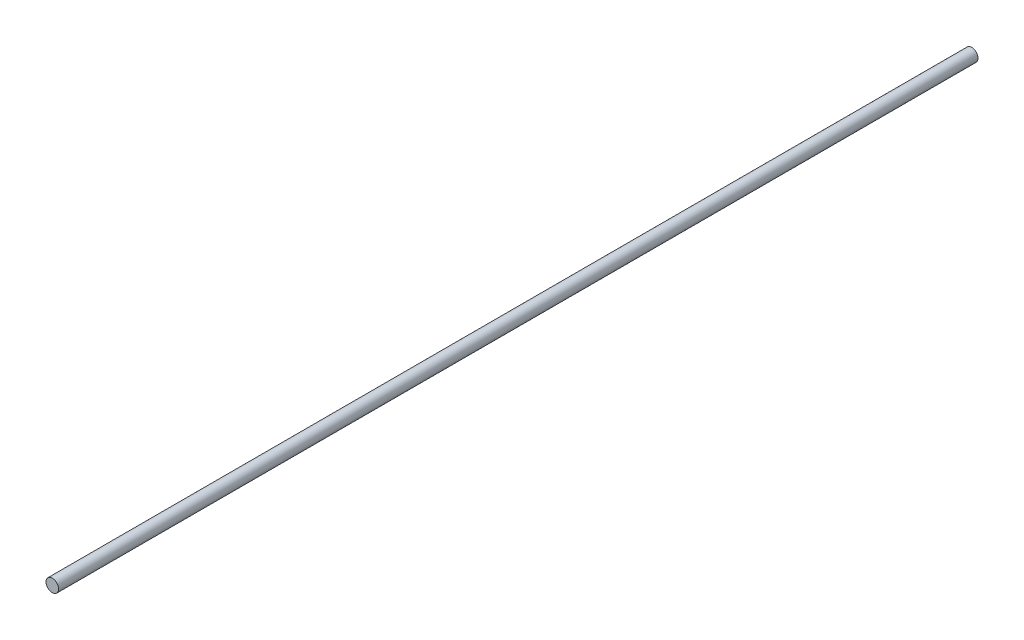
ISO-10303-21;
HEADER;
FILE_DESCRIPTION(('STEP AP214'),'2;1');
FILE_NAME('part.step','',(''),(''),'','','');
FILE_SCHEMA(('AUTOMOTIVE_DESIGN { 1 0 10303 214 1 1 1 1 }'));
ENDSEC;
DATA;
#1=APPLICATION_CONTEXT('core data for automotive mechanical design processes');
#2=APPLICATION_PROTOCOL_DEFINITION('international standard','automotive_design',2000,#1);
#3=PRODUCT_CONTEXT('',#1,'mechanical');
#4=PRODUCT('Part','Part','',(#3));
#5=PRODUCT_RELATED_PRODUCT_CATEGORY('part','',(#4));
#6=PRODUCT_DEFINITION_FORMATION('','',#4);
#7=PRODUCT_DEFINITION_CONTEXT('part definition',#1,'design');
#8=PRODUCT_DEFINITION('design','',#6,#7);
#9=PRODUCT_DEFINITION_SHAPE('','',#8);
#10=(LENGTH_UNIT() NAMED_UNIT(*) SI_UNIT(.MILLI.,.METRE.));
#11=(NAMED_UNIT(*) PLANE_ANGLE_UNIT() SI_UNIT($,.RADIAN.));
#12=(NAMED_UNIT(*) SI_UNIT($,.STERADIAN.) SOLID_ANGLE_UNIT());
#13=UNCERTAINTY_MEASURE_WITH_UNIT(LENGTH_MEASURE(1.E-05),#10,'distance_accuracy_value','');
#14=(GEOMETRIC_REPRESENTATION_CONTEXT(3) GLOBAL_UNCERTAINTY_ASSIGNED_CONTEXT((#13)) GLOBAL_UNIT_ASSIGNED_CONTEXT((#10,
#11,#12)) REPRESENTATION_CONTEXT('',''));
#15=CARTESIAN_POINT('',(0.,0.,0.));
#16=DIRECTION('',(0.,0.,1.));
#17=DIRECTION('',(1.,0.,0.));
#18=AXIS2_PLACEMENT_3D('',#15,#16,#17);
#19=CARTESIAN_POINT('',(0.,0.,730.));
#20=DIRECTION('',(0.,0.,-1.));
#21=DIRECTION('',(-1.,0.,0.));
#22=AXIS2_PLACEMENT_3D('',#19,#20,#21);
#23=CYLINDRICAL_SURFACE('',#22,10.);
#24=CARTESIAN_POINT('',(0.,0.,730.));
#25=DIRECTION('',(0.,0.,1.));
#26=DIRECTION('',(1.,0.,0.));
#27=AXIS2_PLACEMENT_3D('',#24,#25,#26);
#28=CIRCLE('',#27,10.);
#29=CARTESIAN_POINT('',(-10.,0.,730.));
#30=VERTEX_POINT('',#29);
#31=EDGE_CURVE('E10',#30,#30,#28,.T.);
#32=CARTESIAN_POINT('',(0.,0.,-730.));
#33=DIRECTION('',(0.,0.,1.));
#34=DIRECTION('',(1.,0.,0.));
#35=AXIS2_PLACEMENT_3D('',#32,#33,#34);
#36=CIRCLE('',#35,10.);
#37=CARTESIAN_POINT('',(-10.,0.,-730.));
#38=VERTEX_POINT('',#37);
#39=EDGE_CURVE('E40',#38,#38,#36,.T.);
#40=CARTESIAN_POINT('',(-10.,0.,730.));
#41=CARTESIAN_POINT('',(-10.,0.,714.791666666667));
#42=CARTESIAN_POINT('',(-10.,0.,699.583333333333));
#43=CARTESIAN_POINT('',(-10.,0.,669.166666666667));
#44=CARTESIAN_POINT('',(-10.,0.,653.958333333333));
#45=CARTESIAN_POINT('',(-10.,0.,623.541666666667));
#46=CARTESIAN_POINT('',(-10.,0.,608.333333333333));
#47=CARTESIAN_POINT('',(-10.,0.,577.916666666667));
#48=CARTESIAN_POINT('',(-10.,0.,562.708333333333));
#49=CARTESIAN_POINT('',(-10.,0.,532.291666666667));
#50=CARTESIAN_POINT('',(-10.,0.,517.083333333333));
#51=CARTESIAN_POINT('',(-10.,0.,486.666666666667));
#52=CARTESIAN_POINT('',(-10.,0.,471.458333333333));
#53=CARTESIAN_POINT('',(-10.,0.,441.041666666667));
#54=CARTESIAN_POINT('',(-10.,0.,425.833333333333));
#55=CARTESIAN_POINT('',(-10.,0.,395.416666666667));
#56=CARTESIAN_POINT('',(-10.,0.,380.208333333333));
#57=CARTESIAN_POINT('',(-10.,0.,349.791666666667));
#58=CARTESIAN_POINT('',(-10.,0.,334.583333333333));
#59=CARTESIAN_POINT('',(-10.,0.,304.166666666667));
#60=CARTESIAN_POINT('',(-10.,0.,288.958333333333));
#61=CARTESIAN_POINT('',(-10.,0.,258.541666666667));
#62=CARTESIAN_POINT('',(-10.,0.,243.333333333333));
#63=CARTESIAN_POINT('',(-10.,0.,212.916666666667));
#64=CARTESIAN_POINT('',(-10.,0.,197.708333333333));
#65=CARTESIAN_POINT('',(-10.,0.,167.291666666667));
#66=CARTESIAN_POINT('',(-10.,0.,152.083333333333));
#67=CARTESIAN_POINT('',(-10.,0.,121.666666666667));
#68=CARTESIAN_POINT('',(-10.,0.,106.458333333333));
#69=CARTESIAN_POINT('',(-10.,0.,76.0416666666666));
#70=CARTESIAN_POINT('',(-10.,0.,60.8333333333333));
#71=CARTESIAN_POINT('',(-10.,0.,30.4166666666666));
#72=CARTESIAN_POINT('',(-10.,0.,15.2083333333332));
#73=CARTESIAN_POINT('',(-10.,0.,-15.2083333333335));
#74=CARTESIAN_POINT('',(-10.,0.,-30.4166666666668));
#75=CARTESIAN_POINT('',(-10.,0.,-60.8333333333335));
#76=CARTESIAN_POINT('',(-10.,0.,-76.0416666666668));
#77=CARTESIAN_POINT('',(-10.,0.,-106.458333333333));
#78=CARTESIAN_POINT('',(-10.,0.,-121.666666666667));
#79=CARTESIAN_POINT('',(-10.,0.,-152.083333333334));
#80=CARTESIAN_POINT('',(-10.,0.,-167.291666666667));
#81=CARTESIAN_POINT('',(-10.,0.,-197.708333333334));
#82=CARTESIAN_POINT('',(-10.,0.,-212.916666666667));
#83=CARTESIAN_POINT('',(-10.,0.,-243.333333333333));
#84=CARTESIAN_POINT('',(-10.,0.,-258.541666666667));
#85=CARTESIAN_POINT('',(-10.,0.,-288.958333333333));
#86=CARTESIAN_POINT('',(-10.,0.,-304.166666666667));
#87=CARTESIAN_POINT('',(-10.,0.,-334.583333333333));
#88=CARTESIAN_POINT('',(-10.,0.,-349.791666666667));
#89=CARTESIAN_POINT('',(-10.,0.,-380.208333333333));
#90=CARTESIAN_POINT('',(-10.,0.,-395.416666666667));
#91=CARTESIAN_POINT('',(-10.,0.,-425.833333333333));
#92=CARTESIAN_POINT('',(-10.,0.,-441.041666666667));
#93=CARTESIAN_POINT('',(-10.,0.,-471.458333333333));
#94=CARTESIAN_POINT('',(-10.,0.,-486.666666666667));
#95=CARTESIAN_POINT('',(-10.,0.,-517.083333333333));
#96=CARTESIAN_POINT('',(-10.,0.,-532.291666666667));
#97=CARTESIAN_POINT('',(-10.,0.,-562.708333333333));
#98=CARTESIAN_POINT('',(-10.,0.,-577.916666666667));
#99=CARTESIAN_POINT('',(-10.,0.,-608.333333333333));
#100=CARTESIAN_POINT('',(-10.,0.,-623.541666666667));
#101=CARTESIAN_POINT('',(-10.,0.,-653.958333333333));
#102=CARTESIAN_POINT('',(-10.,0.,-669.166666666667));
#103=CARTESIAN_POINT('',(-10.,0.,-699.583333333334));
#104=CARTESIAN_POINT('',(-10.,0.,-714.791666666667));
#105=CARTESIAN_POINT('',(-10.,0.,-730.));
#106=B_SPLINE_CURVE_WITH_KNOTS('',3,(#40,#41,#42,#43,#44,#45,#46,#47,#48,#49,#50,#51,#52,#53,
#54,#55,#56,#57,#58,#59,#60,#61,#62,#63,#64,#65,#66,#67,#68,#69,#70,#71,#72,#73,#74,#75,#76,#77,
#78,#79,#80,#81,#82,#83,#84,#85,#86,#87,#88,#89,#90,#91,#92,#93,#94,#95,#96,#97,#98,#99,#100,
#101,#102,#103,#104,#105),.UNSPECIFIED.,.F.,.F.,(4,2,2,2,2,2,2,2,2,2,2,2,2,2,2,2,2,2,2,2,2,2,2,
2,2,2,2,2,2,2,2,2,4),(0.,45.625,91.2500000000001,136.875,182.5,228.125,273.75,319.375,365.,
410.625,456.25,501.875,547.5,593.125,638.75,684.375,730.,775.625,821.25,866.875,912.5,958.125,
1003.75,1049.375,1095.,1140.625,1186.25,1231.875,1277.5,1323.125,1368.75,1414.375,1460.),.UNSPECIFIED.);
#107=EDGE_CURVE('BSEAM37',#30,#38,#106,.T.);
#108=ORIENTED_EDGE('',*,*,#31,.F.);
#109=ORIENTED_EDGE('',*,*,#39,.T.);
#110=ORIENTED_EDGE('',*,*,#107,.T.);
#111=ORIENTED_EDGE('',*,*,#107,.F.);
#112=EDGE_LOOP('',(#108,#110,#109,#111));
#113=FACE_BOUND('',#112,.T.);
#114=ADVANCED_FACE('F37',(#113),#23,.T.);
#115=CARTESIAN_POINT('',(0.,0.,730.));
#116=DIRECTION('',(0.,0.,1.));
#117=DIRECTION('',(1.,0.,0.));
#118=AXIS2_PLACEMENT_3D('',#115,#116,#117);
#119=PLANE('',#118);
#120=ORIENTED_EDGE('',*,*,#31,.T.);
#121=EDGE_LOOP('',(#120));
#122=FACE_BOUND('',#121,.T.);
#123=ADVANCED_FACE('F52',(#122),#119,.T.);
#124=CARTESIAN_POINT('',(0.,0.,-730.));
#125=DIRECTION('',(0.,0.,1.));
#126=DIRECTION('',(1.,0.,0.));
#127=AXIS2_PLACEMENT_3D('',#124,#125,#126);
#128=PLANE('',#127);
#129=ORIENTED_EDGE('',*,*,#39,.F.);
#130=EDGE_LOOP('',(#129));
#131=FACE_BOUND('',#130,.T.);
#132=ADVANCED_FACE('F50',(#131),#128,.F.);
#133=CLOSED_SHELL('',(#114,#123,#132));
#134=MANIFOLD_SOLID_BREP('B2',#133);
#135=ADVANCED_BREP_SHAPE_REPRESENTATION('',(#18,#134),#14);
#136=SHAPE_DEFINITION_REPRESENTATION(#9,#135);
ENDSEC;
END-ISO-10303-21;
